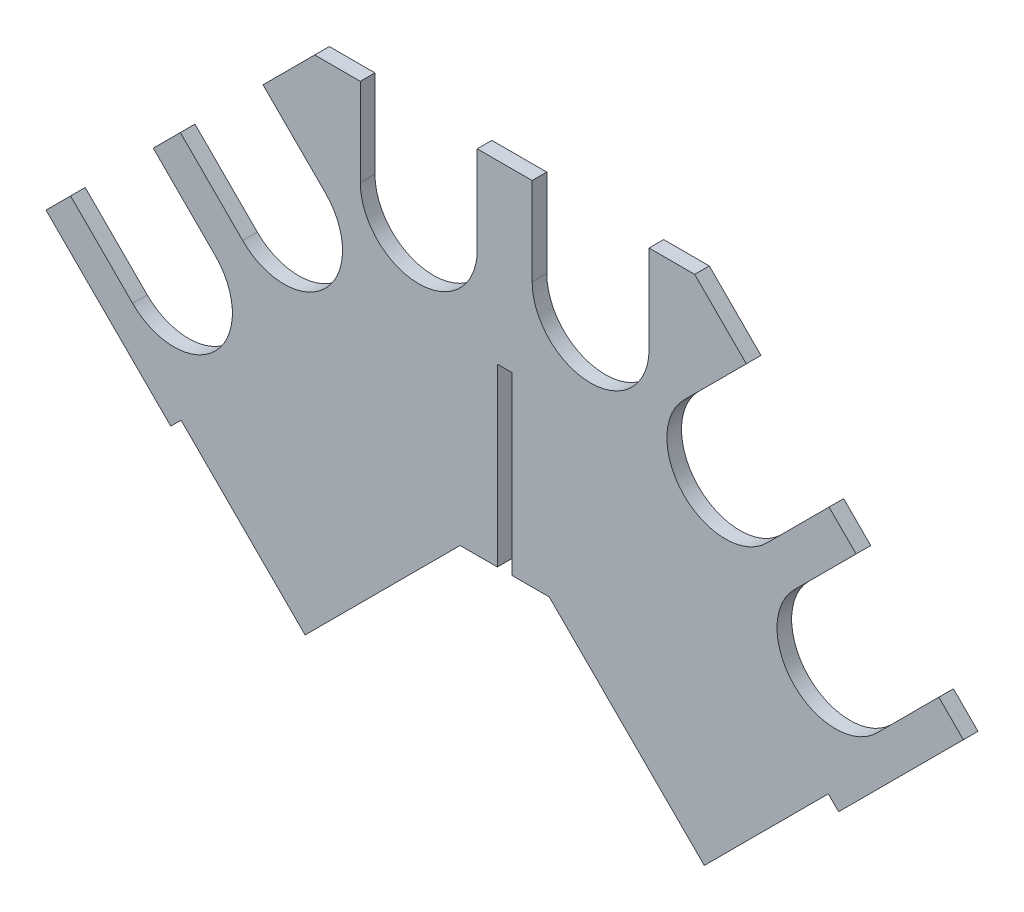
ISO-10303-21;
HEADER;
FILE_DESCRIPTION(('STEP AP214'),'2;1');
FILE_NAME('part.step','',(''),(''),'','','');
FILE_SCHEMA(('AUTOMOTIVE_DESIGN { 1 0 10303 214 1 1 1 1 }'));
ENDSEC;
DATA;
#1=APPLICATION_CONTEXT('core data for automotive mechanical design processes');
#2=APPLICATION_PROTOCOL_DEFINITION('international standard','automotive_design',2000,#1);
#3=PRODUCT_CONTEXT('',#1,'mechanical');
#4=PRODUCT('Part','Part','',(#3));
#5=PRODUCT_RELATED_PRODUCT_CATEGORY('part','',(#4));
#6=PRODUCT_DEFINITION_FORMATION('','',#4);
#7=PRODUCT_DEFINITION_CONTEXT('part definition',#1,'design');
#8=PRODUCT_DEFINITION('design','',#6,#7);
#9=PRODUCT_DEFINITION_SHAPE('','',#8);
#10=(LENGTH_UNIT() NAMED_UNIT(*) SI_UNIT(.MILLI.,.METRE.));
#11=(NAMED_UNIT(*) PLANE_ANGLE_UNIT() SI_UNIT($,.RADIAN.));
#12=(NAMED_UNIT(*) SI_UNIT($,.STERADIAN.) SOLID_ANGLE_UNIT());
#13=UNCERTAINTY_MEASURE_WITH_UNIT(LENGTH_MEASURE(1.E-05),#10,'distance_accuracy_value','');
#14=(GEOMETRIC_REPRESENTATION_CONTEXT(3) GLOBAL_UNCERTAINTY_ASSIGNED_CONTEXT((#13)) GLOBAL_UNIT_ASSIGNED_CONTEXT((#10,
#11,#12)) REPRESENTATION_CONTEXT('',''));
#15=CARTESIAN_POINT('',(0.,0.,0.));
#16=DIRECTION('',(0.,0.,1.));
#17=DIRECTION('',(1.,0.,0.));
#18=AXIS2_PLACEMENT_3D('',#15,#16,#17);
#19=CARTESIAN_POINT('',(-165.1,632.073318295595,12.7));
#20=DIRECTION('',(0.707106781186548,-0.707106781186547,0.));
#21=DIRECTION('',(0.707106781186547,0.707106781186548,0.));
#22=AXIS2_PLACEMENT_3D('',#19,#20,#21);
#23=PLANE('',#22);
#24=DIRECTION('',(-0.707106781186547,-0.707106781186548,0.));
#25=VECTOR('',#24,1.);
#26=CARTESIAN_POINT('',(-165.1,632.073318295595,0.));
#27=LINE('',#26,#25);
#28=CARTESIAN_POINT('',(-281.843329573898,515.329988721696,0.));
#29=VERTEX_POINT('',#28);
#30=CARTESIAN_POINT('',(-305.383457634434,491.789860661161,0.));
#31=VERTEX_POINT('',#30);
#32=EDGE_CURVE('E311',#29,#31,#27,.T.);
#33=ORIENTED_EDGE('',*,*,#32,.T.);
#34=DIRECTION('',(0.,0.,1.));
#35=VECTOR('',#34,1.);
#36=CARTESIAN_POINT('',(-305.383457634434,491.789860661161,-0.000999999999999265));
#37=LINE('',#36,#35);
#38=CARTESIAN_POINT('',(-305.383457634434,491.789860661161,12.7));
#39=VERTEX_POINT('',#38);
#40=EDGE_CURVE('E296',#31,#39,#37,.T.);
#41=ORIENTED_EDGE('',*,*,#40,.T.);
#42=DIRECTION('',(-0.707106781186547,-0.707106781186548,0.));
#43=VECTOR('',#42,1.);
#44=CARTESIAN_POINT('',(-165.1,632.073318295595,12.7));
#45=LINE('',#44,#43);
#46=CARTESIAN_POINT('',(-281.843329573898,515.329988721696,12.7));
#47=VERTEX_POINT('',#46);
#48=EDGE_CURVE('E553',#47,#39,#45,.T.);
#49=ORIENTED_EDGE('',*,*,#48,.F.);
#50=DIRECTION('',(0.,0.,1.));
#51=VECTOR('',#50,1.);
#52=CARTESIAN_POINT('',(-281.843329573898,515.329988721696,-0.000999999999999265));
#53=LINE('',#52,#51);
#54=EDGE_CURVE('E598',#29,#47,#53,.T.);
#55=ORIENTED_EDGE('',*,*,#54,.F.);
#56=EDGE_LOOP('',(#33,#41,#49,#55));
#57=FACE_BOUND('',#56,.T.);
#58=ADVANCED_FACE('F31',(#57),#23,.F.);
#59=CARTESIAN_POINT('',(-287.422945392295,401.987299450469,12.7));
#60=DIRECTION('',(0.,0.,-1.));
#61=DIRECTION('',(-1.,0.,0.));
#62=AXIS2_PLACEMENT_3D('',#59,#60,#61);
#63=CYLINDRICAL_SURFACE('',#62,50.8);
#64=CARTESIAN_POINT('',(-287.422945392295,401.987299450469,12.7));
#65=DIRECTION('',(0.,0.,1.));
#66=DIRECTION('',(1.,0.,0.));
#67=AXIS2_PLACEMENT_3D('',#64,#65,#66);
#68=CIRCLE('',#67,50.8);
#69=CARTESIAN_POINT('',(-323.343969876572,366.066274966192,12.7));
#70=VERTEX_POINT('',#69);
#71=CARTESIAN_POINT('',(-251.501920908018,437.908323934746,12.7));
#72=VERTEX_POINT('',#71);
#73=EDGE_CURVE('E516',#70,#72,#68,.T.);
#74=ORIENTED_EDGE('',*,*,#73,.T.);
#75=DIRECTION('',(0.,0.,1.));
#76=VECTOR('',#75,1.);
#77=CARTESIAN_POINT('',(-251.501920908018,437.908323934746,-0.000999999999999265));
#78=LINE('',#77,#76);
#79=CARTESIAN_POINT('',(-251.501920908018,437.908323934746,0.));
#80=VERTEX_POINT('',#79);
#81=EDGE_CURVE('E600',#80,#72,#78,.T.);
#82=ORIENTED_EDGE('',*,*,#81,.F.);
#83=CARTESIAN_POINT('',(-287.422945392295,401.987299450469,0.));
#84=DIRECTION('',(0.,0.,1.));
#85=DIRECTION('',(1.,0.,0.));
#86=AXIS2_PLACEMENT_3D('',#83,#84,#85);
#87=CIRCLE('',#86,50.8);
#88=CARTESIAN_POINT('',(-323.343969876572,366.066274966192,0.));
#89=VERTEX_POINT('',#88);
#90=EDGE_CURVE('E513',#89,#80,#87,.T.);
#91=ORIENTED_EDGE('',*,*,#90,.F.);
#92=DIRECTION('',(0.,0.,1.));
#93=VECTOR('',#92,1.);
#94=CARTESIAN_POINT('',(-323.343969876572,366.066274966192,-0.000999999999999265));
#95=LINE('',#94,#93);
#96=EDGE_CURVE('E290',#89,#70,#95,.T.);
#97=ORIENTED_EDGE('',*,*,#96,.T.);
#98=EDGE_LOOP('',(#74,#82,#91,#97));
#99=FACE_BOUND('',#98,.T.);
#100=ADVANCED_FACE('F674',(#99),#63,.F.);
#101=CARTESIAN_POINT('',(-377.225506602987,419.947811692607,12.7));
#102=VERTEX_POINT('',#101);
#103=CARTESIAN_POINT('',(-398.586659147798,398.586659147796,12.7));
#104=VERTEX_POINT('',#103);
#105=EDGE_CURVE('E304',#102,#104,#45,.T.);
#106=ORIENTED_EDGE('',*,*,#105,.F.);
#107=DIRECTION('',(0.,0.,1.));
#108=VECTOR('',#107,1.);
#109=CARTESIAN_POINT('',(-377.225506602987,419.947811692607,-0.000999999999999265));
#110=LINE('',#109,#108);
#111=CARTESIAN_POINT('',(-377.225506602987,419.947811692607,0.));
#112=VERTEX_POINT('',#111);
#113=EDGE_CURVE('E289',#112,#102,#110,.T.);
#114=ORIENTED_EDGE('',*,*,#113,.F.);
#115=CARTESIAN_POINT('',(-398.586659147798,398.586659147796,0.));
#116=VERTEX_POINT('',#115);
#117=EDGE_CURVE('E302',#112,#116,#27,.T.);
#118=ORIENTED_EDGE('',*,*,#117,.T.);
#119=DIRECTION('',(0.,0.,-1.));
#120=VECTOR('',#119,1.);
#121=CARTESIAN_POINT('',(-398.586659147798,398.586659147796,12.7));
#122=LINE('',#121,#120);
#123=EDGE_CURVE('E354',#104,#116,#122,.T.);
#124=ORIENTED_EDGE('',*,*,#123,.F.);
#125=EDGE_LOOP('',(#106,#114,#118,#124));
#126=FACE_BOUND('',#125,.T.);
#127=ADVANCED_FACE('F300',(#126),#23,.F.);
#128=CARTESIAN_POINT('',(-165.1,632.073318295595,12.7));
#129=DIRECTION('',(0.,-1.,0.));
#130=DIRECTION('',(1.,0.,0.));
#131=AXIS2_PLACEMENT_3D('',#128,#129,#130);
#132=PLANE('',#131);
#133=DIRECTION('',(-1.,0.,0.));
#134=VECTOR('',#133,1.);
#135=CARTESIAN_POINT('',(-165.1,632.073318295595,0.));
#136=LINE('',#135,#134);
#137=CARTESIAN_POINT('',(23.8592316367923,632.073318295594,0.));
#138=VERTEX_POINT('',#137);
#139=CARTESIAN_POINT('',(-23.8592316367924,632.073318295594,0.));
#140=VERTEX_POINT('',#139);
#141=EDGE_CURVE('E317',#138,#140,#136,.T.);
#142=ORIENTED_EDGE('',*,*,#141,.T.);
#143=DIRECTION('',(0.,0.,1.));
#144=VECTOR('',#143,1.);
#145=CARTESIAN_POINT('',(-23.8592316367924,632.073318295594,-0.000999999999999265));
#146=LINE('',#145,#144);
#147=CARTESIAN_POINT('',(-23.8592316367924,632.073318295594,12.7));
#148=VERTEX_POINT('',#147);
#149=EDGE_CURVE('E442',#140,#148,#146,.T.);
#150=ORIENTED_EDGE('',*,*,#149,.T.);
#151=DIRECTION('',(-1.,0.,0.));
#152=VECTOR('',#151,1.);
#153=CARTESIAN_POINT('',(-165.1,632.073318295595,12.7));
#154=LINE('',#153,#152);
#155=CARTESIAN_POINT('',(23.8592316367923,632.073318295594,12.7));
#156=VERTEX_POINT('',#155);
#157=EDGE_CURVE('E548',#156,#148,#154,.T.);
#158=ORIENTED_EDGE('',*,*,#157,.F.);
#159=DIRECTION('',(0.,0.,1.));
#160=VECTOR('',#159,1.);
#161=CARTESIAN_POINT('',(23.8592316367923,632.073318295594,-0.000999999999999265));
#162=LINE('',#161,#160);
#163=EDGE_CURVE('E447',#138,#156,#162,.T.);
#164=ORIENTED_EDGE('',*,*,#163,.F.);
#165=EDGE_LOOP('',(#142,#150,#158,#164));
#166=FACE_BOUND('',#165,.T.);
#167=ADVANCED_FACE('F654',(#166),#132,.F.);
#168=CARTESIAN_POINT('',(-74.6592316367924,555.873318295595,12.7));
#169=DIRECTION('',(0.,0.,-1.));
#170=DIRECTION('',(-1.,0.,0.));
#171=AXIS2_PLACEMENT_3D('',#168,#169,#170);
#172=CYLINDRICAL_SURFACE('',#171,50.8);
#173=CARTESIAN_POINT('',(-74.6592316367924,555.873318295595,12.7));
#174=DIRECTION('',(0.,0.,1.));
#175=DIRECTION('',(1.,0.,0.));
#176=AXIS2_PLACEMENT_3D('',#173,#174,#175);
#177=CIRCLE('',#176,50.8);
#178=CARTESIAN_POINT('',(-125.459231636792,555.873318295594,12.7));
#179=VERTEX_POINT('',#178);
#180=CARTESIAN_POINT('',(-23.8592316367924,555.873318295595,12.7));
#181=VERTEX_POINT('',#180);
#182=EDGE_CURVE('E494',#179,#181,#177,.T.);
#183=ORIENTED_EDGE('',*,*,#182,.T.);
#184=DIRECTION('',(0.,0.,1.));
#185=VECTOR('',#184,1.);
#186=CARTESIAN_POINT('',(-23.8592316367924,555.873318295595,-0.000999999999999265));
#187=LINE('',#186,#185);
#188=CARTESIAN_POINT('',(-23.8592316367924,555.873318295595,0.));
#189=VERTEX_POINT('',#188);
#190=EDGE_CURVE('E630',#189,#181,#187,.T.);
#191=ORIENTED_EDGE('',*,*,#190,.F.);
#192=CARTESIAN_POINT('',(-74.6592316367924,555.873318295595,0.));
#193=DIRECTION('',(0.,0.,1.));
#194=DIRECTION('',(1.,0.,0.));
#195=AXIS2_PLACEMENT_3D('',#192,#193,#194);
#196=CIRCLE('',#195,50.8);
#197=CARTESIAN_POINT('',(-125.459231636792,555.873318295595,0.));
#198=VERTEX_POINT('',#197);
#199=EDGE_CURVE('E493',#198,#189,#196,.T.);
#200=ORIENTED_EDGE('',*,*,#199,.F.);
#201=DIRECTION('',(0.,0.,1.));
#202=VECTOR('',#201,1.);
#203=CARTESIAN_POINT('',(-125.459231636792,555.873318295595,-0.000999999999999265));
#204=LINE('',#203,#202);
#205=EDGE_CURVE('E632',#198,#179,#204,.T.);
#206=ORIENTED_EDGE('',*,*,#205,.T.);
#207=EDGE_LOOP('',(#183,#191,#200,#206));
#208=FACE_BOUND('',#207,.T.);
#209=ADVANCED_FACE('F662',(#208),#172,.F.);
#210=CARTESIAN_POINT('',(165.1,632.073318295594,0.));
#211=VERTEX_POINT('',#210);
#212=CARTESIAN_POINT('',(125.459231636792,632.073318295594,0.));
#213=VERTEX_POINT('',#212);
#214=EDGE_CURVE('E312',#211,#213,#136,.T.);
#215=ORIENTED_EDGE('',*,*,#214,.T.);
#216=DIRECTION('',(0.,0.,1.));
#217=VECTOR('',#216,1.);
#218=CARTESIAN_POINT('',(125.459231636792,632.073318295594,-0.000999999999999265));
#219=LINE('',#218,#217);
#220=CARTESIAN_POINT('',(125.459231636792,632.073318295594,12.7));
#221=VERTEX_POINT('',#220);
#222=EDGE_CURVE('E448',#213,#221,#219,.T.);
#223=ORIENTED_EDGE('',*,*,#222,.T.);
#224=CARTESIAN_POINT('',(165.1,632.073318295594,12.7));
#225=VERTEX_POINT('',#224);
#226=EDGE_CURVE('E428',#225,#221,#154,.T.);
#227=ORIENTED_EDGE('',*,*,#226,.F.);
#228=DIRECTION('',(0.,0.,-1.));
#229=VECTOR('',#228,1.);
#230=CARTESIAN_POINT('',(165.1,632.073318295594,12.7));
#231=LINE('',#230,#229);
#232=EDGE_CURVE('E358',#225,#211,#231,.T.);
#233=ORIENTED_EDGE('',*,*,#232,.T.);
#234=EDGE_LOOP('',(#215,#223,#227,#233));
#235=FACE_BOUND('',#234,.T.);
#236=ADVANCED_FACE('F425',(#235),#132,.F.);
#237=CARTESIAN_POINT('',(74.6592316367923,555.873318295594,12.7));
#238=DIRECTION('',(0.,0.,-1.));
#239=DIRECTION('',(-1.,0.,0.));
#240=AXIS2_PLACEMENT_3D('',#237,#238,#239);
#241=CYLINDRICAL_SURFACE('',#240,50.8);
#242=CARTESIAN_POINT('',(74.6592316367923,555.873318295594,12.7));
#243=DIRECTION('',(0.,0.,1.));
#244=DIRECTION('',(1.,0.,0.));
#245=AXIS2_PLACEMENT_3D('',#242,#243,#244);
#246=CIRCLE('',#245,50.8);
#247=CARTESIAN_POINT('',(23.8592316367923,555.873318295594,12.7));
#248=VERTEX_POINT('',#247);
#249=CARTESIAN_POINT('',(125.459231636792,555.873318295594,12.7));
#250=VERTEX_POINT('',#249);
#251=EDGE_CURVE('E499',#248,#250,#246,.T.);
#252=ORIENTED_EDGE('',*,*,#251,.T.);
#253=DIRECTION('',(0.,0.,1.));
#254=VECTOR('',#253,1.);
#255=CARTESIAN_POINT('',(125.459231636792,555.873318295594,-0.000999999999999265));
#256=LINE('',#255,#254);
#257=CARTESIAN_POINT('',(125.459231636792,555.873318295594,0.));
#258=VERTEX_POINT('',#257);
#259=EDGE_CURVE('E451',#258,#250,#256,.T.);
#260=ORIENTED_EDGE('',*,*,#259,.F.);
#261=CARTESIAN_POINT('',(74.6592316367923,555.873318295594,0.));
#262=DIRECTION('',(0.,0.,1.));
#263=DIRECTION('',(1.,0.,0.));
#264=AXIS2_PLACEMENT_3D('',#261,#262,#263);
#265=CIRCLE('',#264,50.8);
#266=CARTESIAN_POINT('',(23.8592316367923,555.873318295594,0.));
#267=VERTEX_POINT('',#266);
#268=EDGE_CURVE('E434',#267,#258,#265,.T.);
#269=ORIENTED_EDGE('',*,*,#268,.F.);
#270=DIRECTION('',(0.,0.,1.));
#271=VECTOR('',#270,1.);
#272=CARTESIAN_POINT('',(23.8592316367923,555.873318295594,-0.000999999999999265));
#273=LINE('',#272,#271);
#274=EDGE_CURVE('E453',#267,#248,#273,.T.);
#275=ORIENTED_EDGE('',*,*,#274,.T.);
#276=EDGE_LOOP('',(#252,#260,#269,#275));
#277=FACE_BOUND('',#276,.T.);
#278=ADVANCED_FACE('F669',(#277),#241,.F.);
#279=CARTESIAN_POINT('',(165.1,632.073318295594,12.7));
#280=DIRECTION('',(-0.707106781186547,-0.707106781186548,0.));
#281=DIRECTION('',(0.707106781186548,-0.707106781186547,0.));
#282=AXIS2_PLACEMENT_3D('',#279,#280,#281);
#283=PLANE('',#282);
#284=DIRECTION('',(-0.707106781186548,0.707106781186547,0.));
#285=VECTOR('',#284,1.);
#286=CARTESIAN_POINT('',(165.1,632.073318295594,12.7));
#287=LINE('',#286,#285);
#288=CARTESIAN_POINT('',(305.383457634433,491.789860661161,12.7));
#289=VERTEX_POINT('',#288);
#290=CARTESIAN_POINT('',(281.843329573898,515.329988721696,12.7));
#291=VERTEX_POINT('',#290);
#292=EDGE_CURVE('E546',#289,#291,#287,.T.);
#293=ORIENTED_EDGE('',*,*,#292,.F.);
#294=DIRECTION('',(0.,0.,1.));
#295=VECTOR('',#294,1.);
#296=CARTESIAN_POINT('',(305.383457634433,491.789860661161,-0.000999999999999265));
#297=LINE('',#296,#295);
#298=CARTESIAN_POINT('',(305.383457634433,491.789860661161,0.));
#299=VERTEX_POINT('',#298);
#300=EDGE_CURVE('E469',#299,#289,#297,.T.);
#301=ORIENTED_EDGE('',*,*,#300,.F.);
#302=DIRECTION('',(-0.707106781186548,0.707106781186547,0.));
#303=VECTOR('',#302,1.);
#304=CARTESIAN_POINT('',(165.1,632.073318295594,0.));
#305=LINE('',#304,#303);
#306=CARTESIAN_POINT('',(281.843329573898,515.329988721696,0.));
#307=VERTEX_POINT('',#306);
#308=EDGE_CURVE('E410',#299,#307,#305,.T.);
#309=ORIENTED_EDGE('',*,*,#308,.T.);
#310=DIRECTION('',(0.,0.,1.));
#311=VECTOR('',#310,1.);
#312=CARTESIAN_POINT('',(281.843329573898,515.329988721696,-0.000999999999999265));
#313=LINE('',#312,#311);
#314=EDGE_CURVE('E488',#307,#291,#313,.T.);
#315=ORIENTED_EDGE('',*,*,#314,.T.);
#316=EDGE_LOOP('',(#293,#301,#309,#315));
#317=FACE_BOUND('',#316,.T.);
#318=ADVANCED_FACE('F695',(#317),#283,.F.);
#319=CARTESIAN_POINT('',(210.001280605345,587.172037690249,12.7));
#320=VERTEX_POINT('',#319);
#321=EDGE_CURVE('E541',#320,#225,#287,.T.);
#322=ORIENTED_EDGE('',*,*,#321,.F.);
#323=DIRECTION('',(0.,0.,1.));
#324=VECTOR('',#323,1.);
#325=CARTESIAN_POINT('',(210.001280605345,587.172037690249,-0.000999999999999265));
#326=LINE('',#325,#324);
#327=CARTESIAN_POINT('',(210.001280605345,587.172037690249,0.));
#328=VERTEX_POINT('',#327);
#329=EDGE_CURVE('E421',#328,#320,#326,.T.);
#330=ORIENTED_EDGE('',*,*,#329,.F.);
#331=EDGE_CURVE('E407',#328,#211,#305,.T.);
#332=ORIENTED_EDGE('',*,*,#331,.T.);
#333=ORIENTED_EDGE('',*,*,#232,.F.);
#334=EDGE_LOOP('',(#322,#330,#332,#333));
#335=FACE_BOUND('',#334,.T.);
#336=ADVANCED_FACE('F419',(#335),#283,.F.);
#337=CARTESIAN_POINT('',(-6.35,478.770757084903,12.7));
#338=DIRECTION('',(0.,0.,1.));
#339=DIRECTION('',(1.,0.,0.));
#340=AXIS2_PLACEMENT_3D('',#337,#338,#339);
#341=PLANE('',#340);
#342=DIRECTION('',(-0.707106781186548,0.707106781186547,0.));
#343=VECTOR('',#342,1.);
#344=CARTESIAN_POINT('',(-305.383457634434,491.789860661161,12.7));
#345=LINE('',#344,#343);
#346=EDGE_CURVE('E305',#72,#39,#345,.T.);
#347=ORIENTED_EDGE('',*,*,#346,.F.);
#348=ORIENTED_EDGE('',*,*,#73,.F.);
#349=DIRECTION('',(0.707106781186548,-0.707106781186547,0.));
#350=VECTOR('',#349,1.);
#351=CARTESIAN_POINT('',(-377.225506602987,419.947811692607,12.7));
#352=LINE('',#351,#350);
#353=EDGE_CURVE('E54',#102,#70,#352,.T.);
#354=ORIENTED_EDGE('',*,*,#353,.F.);
#355=ORIENTED_EDGE('',*,*,#105,.T.);
#356=DIRECTION('',(0.707106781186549,-0.707106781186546,0.));
#357=VECTOR('',#356,1.);
#358=CARTESIAN_POINT('',(-290.185378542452,290.185378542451,12.7));
#359=LINE('',#358,#357);
#360=CARTESIAN_POINT('',(-290.185378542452,290.185378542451,12.7));
#361=VERTEX_POINT('',#360);
#362=EDGE_CURVE('E552',#104,#361,#359,.T.);
#363=ORIENTED_EDGE('',*,*,#362,.T.);
#364=DIRECTION('',(0.707106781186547,0.707106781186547,0.));
#365=VECTOR('',#364,1.);
#366=CARTESIAN_POINT('',(-290.185378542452,290.185378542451,12.7));
#367=LINE('',#366,#365);
#368=CARTESIAN_POINT('',(-281.205122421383,299.16563466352,12.7));
#369=VERTEX_POINT('',#368);
#370=EDGE_CURVE('E555',#361,#369,#367,.T.);
#371=ORIENTED_EDGE('',*,*,#370,.T.);
#372=DIRECTION('',(0.707106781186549,-0.707106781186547,0.));
#373=VECTOR('',#372,1.);
#374=CARTESIAN_POINT('',(-281.205122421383,299.16563466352,12.7));
#375=LINE('',#374,#373);
#376=CARTESIAN_POINT('',(-173.442048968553,191.402561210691,12.7));
#377=VERTEX_POINT('',#376);
#378=EDGE_CURVE('E557',#369,#377,#375,.T.);
#379=ORIENTED_EDGE('',*,*,#378,.T.);
#380=DIRECTION('',(0.707106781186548,0.707106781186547,0.));
#381=VECTOR('',#380,1.);
#382=CARTESIAN_POINT('',(-173.442048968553,191.402561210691,12.7));
#383=LINE('',#382,#381);
#384=CARTESIAN_POINT('',(-38.7382071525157,326.106403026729,12.7));
#385=VERTEX_POINT('',#384);
#386=EDGE_CURVE('E559',#377,#385,#383,.T.);
#387=ORIENTED_EDGE('',*,*,#386,.T.);
#388=DIRECTION('',(1.,0.,0.));
#389=VECTOR('',#388,1.);
#390=CARTESIAN_POINT('',(-38.7382071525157,326.106403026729,12.7));
#391=LINE('',#390,#389);
#392=CARTESIAN_POINT('',(-6.35,326.106403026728,12.7));
#393=VERTEX_POINT('',#392);
#394=EDGE_CURVE('E343',#385,#393,#391,.T.);
#395=ORIENTED_EDGE('',*,*,#394,.T.);
#396=DIRECTION('',(0.,1.,0.));
#397=VECTOR('',#396,1.);
#398=CARTESIAN_POINT('',(-6.35,478.770757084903,12.7));
#399=LINE('',#398,#397);
#400=CARTESIAN_POINT('',(-6.35,478.770757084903,12.7));
#401=VERTEX_POINT('',#400);
#402=EDGE_CURVE('E338',#393,#401,#399,.T.);
#403=ORIENTED_EDGE('',*,*,#402,.T.);
#404=DIRECTION('',(1.,0.,0.));
#405=VECTOR('',#404,1.);
#406=CARTESIAN_POINT('',(-6.35,478.770757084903,12.7));
#407=LINE('',#406,#405);
#408=CARTESIAN_POINT('',(6.35,478.770757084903,12.7));
#409=VERTEX_POINT('',#408);
#410=EDGE_CURVE('E528',#401,#409,#407,.T.);
#411=ORIENTED_EDGE('',*,*,#410,.T.);
#412=DIRECTION('',(0.,-1.,0.));
#413=VECTOR('',#412,1.);
#414=CARTESIAN_POINT('',(6.35,478.770757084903,12.7));
#415=LINE('',#414,#413);
#416=CARTESIAN_POINT('',(6.35,326.106403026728,12.7));
#417=VERTEX_POINT('',#416);
#418=EDGE_CURVE('E386',#409,#417,#415,.T.);
#419=ORIENTED_EDGE('',*,*,#418,.T.);
#420=DIRECTION('',(1.,0.,0.));
#421=VECTOR('',#420,1.);
#422=CARTESIAN_POINT('',(6.35,326.106403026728,12.7));
#423=LINE('',#422,#421);
#424=CARTESIAN_POINT('',(38.7382071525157,326.106403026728,12.7));
#425=VERTEX_POINT('',#424);
#426=EDGE_CURVE('E531',#417,#425,#423,.T.);
#427=ORIENTED_EDGE('',*,*,#426,.T.);
#428=DIRECTION('',(0.707106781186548,-0.707106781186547,0.));
#429=VECTOR('',#428,1.);
#430=CARTESIAN_POINT('',(173.442048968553,191.402561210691,12.7));
#431=LINE('',#430,#429);
#432=CARTESIAN_POINT('',(173.442048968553,191.402561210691,12.7));
#433=VERTEX_POINT('',#432);
#434=EDGE_CURVE('E533',#425,#433,#431,.T.);
#435=ORIENTED_EDGE('',*,*,#434,.T.);
#436=DIRECTION('',(0.707106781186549,0.707106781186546,0.));
#437=VECTOR('',#436,1.);
#438=CARTESIAN_POINT('',(173.442048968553,191.402561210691,12.7));
#439=LINE('',#438,#437);
#440=CARTESIAN_POINT('',(281.205122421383,299.16563466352,12.7));
#441=VERTEX_POINT('',#440);
#442=EDGE_CURVE('E535',#433,#441,#439,.T.);
#443=ORIENTED_EDGE('',*,*,#442,.T.);
#444=DIRECTION('',(0.707106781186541,-0.707106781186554,0.));
#445=VECTOR('',#444,1.);
#446=CARTESIAN_POINT('',(281.205122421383,299.16563466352,12.7));
#447=LINE('',#446,#445);
#448=CARTESIAN_POINT('',(290.185378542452,290.185378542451,12.7));
#449=VERTEX_POINT('',#448);
#450=EDGE_CURVE('E537',#441,#449,#447,.T.);
#451=ORIENTED_EDGE('',*,*,#450,.T.);
#452=DIRECTION('',(0.707106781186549,0.707106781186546,0.));
#453=VECTOR('',#452,1.);
#454=CARTESIAN_POINT('',(290.185378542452,290.185378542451,12.7));
#455=LINE('',#454,#453);
#456=CARTESIAN_POINT('',(398.586659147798,398.586659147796,12.7));
#457=VERTEX_POINT('',#456);
#458=EDGE_CURVE('E539',#449,#457,#455,.T.);
#459=ORIENTED_EDGE('',*,*,#458,.T.);
#460=CARTESIAN_POINT('',(377.225506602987,419.947811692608,12.7));
#461=VERTEX_POINT('',#460);
#462=EDGE_CURVE('E542',#457,#461,#287,.T.);
#463=ORIENTED_EDGE('',*,*,#462,.T.);
#464=DIRECTION('',(0.707106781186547,0.707106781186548,0.));
#465=VECTOR('',#464,1.);
#466=CARTESIAN_POINT('',(323.343969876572,366.066274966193,12.7));
#467=LINE('',#466,#465);
#468=CARTESIAN_POINT('',(323.343969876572,366.066274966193,12.7));
#469=VERTEX_POINT('',#468);
#470=EDGE_CURVE('E460',#469,#461,#467,.T.);
#471=ORIENTED_EDGE('',*,*,#470,.F.);
#472=CARTESIAN_POINT('',(287.422945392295,401.987299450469,12.7));
#473=DIRECTION('',(0.,0.,1.));
#474=DIRECTION('',(1.,0.,0.));
#475=AXIS2_PLACEMENT_3D('',#472,#473,#474);
#476=CIRCLE('',#475,50.8);
#477=CARTESIAN_POINT('',(251.501920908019,437.908323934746,12.7));
#478=VERTEX_POINT('',#477);
#479=EDGE_CURVE('E521',#478,#469,#476,.T.);
#480=ORIENTED_EDGE('',*,*,#479,.F.);
#481=DIRECTION('',(-0.707106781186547,-0.707106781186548,0.));
#482=VECTOR('',#481,1.);
#483=CARTESIAN_POINT('',(251.501920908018,437.908323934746,12.7));
#484=LINE('',#483,#482);
#485=EDGE_CURVE('E462',#289,#478,#484,.T.);
#486=ORIENTED_EDGE('',*,*,#485,.F.);
#487=ORIENTED_EDGE('',*,*,#292,.T.);
#488=DIRECTION('',(0.707106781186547,0.707106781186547,0.));
#489=VECTOR('',#488,1.);
#490=CARTESIAN_POINT('',(227.642689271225,461.129348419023,12.7));
#491=LINE('',#490,#489);
#492=CARTESIAN_POINT('',(227.642689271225,461.129348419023,12.7));
#493=VERTEX_POINT('',#492);
#494=EDGE_CURVE('E477',#493,#291,#491,.T.);
#495=ORIENTED_EDGE('',*,*,#494,.F.);
#496=CARTESIAN_POINT('',(191.721664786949,497.050372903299,12.7));
#497=DIRECTION('',(0.,0.,1.));
#498=DIRECTION('',(1.,0.,0.));
#499=AXIS2_PLACEMENT_3D('',#496,#497,#498);
#500=CIRCLE('',#499,50.8);
#501=CARTESIAN_POINT('',(155.800640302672,532.971397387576,12.7));
#502=VERTEX_POINT('',#501);
#503=EDGE_CURVE('E504',#502,#493,#500,.T.);
#504=ORIENTED_EDGE('',*,*,#503,.F.);
#505=DIRECTION('',(-0.707106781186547,-0.707106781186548,0.));
#506=VECTOR('',#505,1.);
#507=CARTESIAN_POINT('',(210.001280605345,587.172037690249,12.7));
#508=LINE('',#507,#506);
#509=EDGE_CURVE('E480',#320,#502,#508,.T.);
#510=ORIENTED_EDGE('',*,*,#509,.F.);
#511=ORIENTED_EDGE('',*,*,#321,.T.);
#512=ORIENTED_EDGE('',*,*,#226,.T.);
#513=DIRECTION('',(0.,1.,0.));
#514=VECTOR('',#513,1.);
#515=CARTESIAN_POINT('',(125.459231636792,632.073318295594,12.7));
#516=LINE('',#515,#514);
#517=EDGE_CURVE('E440',#250,#221,#516,.T.);
#518=ORIENTED_EDGE('',*,*,#517,.F.);
#519=ORIENTED_EDGE('',*,*,#251,.F.);
#520=DIRECTION('',(0.,-1.,0.));
#521=VECTOR('',#520,1.);
#522=CARTESIAN_POINT('',(23.8592316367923,632.073318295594,12.7));
#523=LINE('',#522,#521);
#524=EDGE_CURVE('E437',#156,#248,#523,.T.);
#525=ORIENTED_EDGE('',*,*,#524,.F.);
#526=ORIENTED_EDGE('',*,*,#157,.T.);
#527=DIRECTION('',(0.,1.,0.));
#528=VECTOR('',#527,1.);
#529=CARTESIAN_POINT('',(-23.8592316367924,632.073318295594,12.7));
#530=LINE('',#529,#528);
#531=EDGE_CURVE('E625',#181,#148,#530,.T.);
#532=ORIENTED_EDGE('',*,*,#531,.F.);
#533=ORIENTED_EDGE('',*,*,#182,.F.);
#534=DIRECTION('',(0.,-1.,0.));
#535=VECTOR('',#534,1.);
#536=CARTESIAN_POINT('',(-125.459231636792,632.073318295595,12.7));
#537=LINE('',#536,#535);
#538=CARTESIAN_POINT('',(-125.459231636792,632.073318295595,12.7));
#539=VERTEX_POINT('',#538);
#540=EDGE_CURVE('E623',#539,#179,#537,.T.);
#541=ORIENTED_EDGE('',*,*,#540,.F.);
#542=CARTESIAN_POINT('',(-165.1,632.073318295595,12.7));
#543=VERTEX_POINT('',#542);
#544=EDGE_CURVE('E545',#539,#543,#154,.T.);
#545=ORIENTED_EDGE('',*,*,#544,.T.);
#546=CARTESIAN_POINT('',(-210.001280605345,587.172037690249,12.7));
#547=VERTEX_POINT('',#546);
#548=EDGE_CURVE('E549',#543,#547,#45,.T.);
#549=ORIENTED_EDGE('',*,*,#548,.T.);
#550=DIRECTION('',(-0.707106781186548,0.707106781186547,0.));
#551=VECTOR('',#550,1.);
#552=CARTESIAN_POINT('',(-210.001280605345,587.172037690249,12.7));
#553=LINE('',#552,#551);
#554=CARTESIAN_POINT('',(-155.800640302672,532.971397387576,12.7));
#555=VERTEX_POINT('',#554);
#556=EDGE_CURVE('E608',#555,#547,#553,.T.);
#557=ORIENTED_EDGE('',*,*,#556,.F.);
#558=CARTESIAN_POINT('',(-191.721664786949,497.0503729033,12.7));
#559=DIRECTION('',(0.,0.,1.));
#560=DIRECTION('',(1.,0.,0.));
#561=AXIS2_PLACEMENT_3D('',#558,#559,#560);
#562=CIRCLE('',#561,50.8);
#563=CARTESIAN_POINT('',(-227.642689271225,461.129348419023,12.7));
#564=VERTEX_POINT('',#563);
#565=EDGE_CURVE('E510',#564,#555,#562,.T.);
#566=ORIENTED_EDGE('',*,*,#565,.F.);
#567=DIRECTION('',(0.707106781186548,-0.707106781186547,0.));
#568=VECTOR('',#567,1.);
#569=CARTESIAN_POINT('',(-281.843329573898,515.329988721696,12.7));
#570=LINE('',#569,#568);
#571=EDGE_CURVE('E594',#47,#564,#570,.T.);
#572=ORIENTED_EDGE('',*,*,#571,.F.);
#573=ORIENTED_EDGE('',*,*,#48,.T.);
#574=EDGE_LOOP('',(#347,#348,#354,#355,#363,#371,#379,#387,#395,#403,#411,#419,#427,#435,#443,
#451,#459,#463,#471,#480,#486,#487,#495,#504,#510,#511,#512,#518,#519,#525,#526,#532,#533,#541,
#545,#549,#557,#566,#572,#573));
#575=FACE_BOUND('',#574,.T.);
#576=ADVANCED_FACE('F588',(#575),#341,.T.);
#577=CARTESIAN_POINT('',(-6.35,478.770757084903,0.));
#578=DIRECTION('',(0.,0.,1.));
#579=DIRECTION('',(1.,0.,0.));
#580=AXIS2_PLACEMENT_3D('',#577,#578,#579);
#581=PLANE('',#580);
#582=ORIENTED_EDGE('',*,*,#90,.T.);
#583=DIRECTION('',(0.707106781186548,-0.707106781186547,0.));
#584=VECTOR('',#583,1.);
#585=CARTESIAN_POINT('',(-305.383457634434,491.789860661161,0.));
#586=LINE('',#585,#584);
#587=EDGE_CURVE('E46',#31,#80,#586,.T.);
#588=ORIENTED_EDGE('',*,*,#587,.F.);
#589=ORIENTED_EDGE('',*,*,#32,.F.);
#590=DIRECTION('',(-0.707106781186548,0.707106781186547,0.));
#591=VECTOR('',#590,1.);
#592=CARTESIAN_POINT('',(-281.843329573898,515.329988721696,0.));
#593=LINE('',#592,#591);
#594=CARTESIAN_POINT('',(-227.642689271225,461.129348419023,0.));
#595=VERTEX_POINT('',#594);
#596=EDGE_CURVE('E295',#595,#29,#593,.T.);
#597=ORIENTED_EDGE('',*,*,#596,.F.);
#598=CARTESIAN_POINT('',(-191.721664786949,497.0503729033,0.));
#599=DIRECTION('',(0.,0.,1.));
#600=DIRECTION('',(1.,0.,0.));
#601=AXIS2_PLACEMENT_3D('',#598,#599,#600);
#602=CIRCLE('',#601,50.8);
#603=CARTESIAN_POINT('',(-155.800640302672,532.971397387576,0.));
#604=VERTEX_POINT('',#603);
#605=EDGE_CURVE('E507',#595,#604,#602,.T.);
#606=ORIENTED_EDGE('',*,*,#605,.T.);
#607=DIRECTION('',(0.707106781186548,-0.707106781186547,0.));
#608=VECTOR('',#607,1.);
#609=CARTESIAN_POINT('',(-210.001280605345,587.172037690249,0.));
#610=LINE('',#609,#608);
#611=CARTESIAN_POINT('',(-210.001280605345,587.172037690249,0.));
#612=VERTEX_POINT('',#611);
#613=EDGE_CURVE('E615',#612,#604,#610,.T.);
#614=ORIENTED_EDGE('',*,*,#613,.F.);
#615=CARTESIAN_POINT('',(-165.1,632.073318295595,0.));
#616=VERTEX_POINT('',#615);
#617=EDGE_CURVE('E314',#616,#612,#27,.T.);
#618=ORIENTED_EDGE('',*,*,#617,.F.);
#619=CARTESIAN_POINT('',(-125.459231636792,632.073318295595,0.));
#620=VERTEX_POINT('',#619);
#621=EDGE_CURVE('E319',#620,#616,#136,.T.);
#622=ORIENTED_EDGE('',*,*,#621,.F.);
#623=DIRECTION('',(0.,1.,0.));
#624=VECTOR('',#623,1.);
#625=CARTESIAN_POINT('',(-125.459231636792,632.073318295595,0.));
#626=LINE('',#625,#624);
#627=EDGE_CURVE('E438',#198,#620,#626,.T.);
#628=ORIENTED_EDGE('',*,*,#627,.F.);
#629=ORIENTED_EDGE('',*,*,#199,.T.);
#630=DIRECTION('',(0.,-1.,0.));
#631=VECTOR('',#630,1.);
#632=CARTESIAN_POINT('',(-23.8592316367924,632.073318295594,0.));
#633=LINE('',#632,#631);
#634=EDGE_CURVE('E621',#140,#189,#633,.T.);
#635=ORIENTED_EDGE('',*,*,#634,.F.);
#636=ORIENTED_EDGE('',*,*,#141,.F.);
#637=DIRECTION('',(0.,1.,0.));
#638=VECTOR('',#637,1.);
#639=CARTESIAN_POINT('',(23.8592316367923,632.073318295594,0.));
#640=LINE('',#639,#638);
#641=EDGE_CURVE('E450',#267,#138,#640,.T.);
#642=ORIENTED_EDGE('',*,*,#641,.F.);
#643=ORIENTED_EDGE('',*,*,#268,.T.);
#644=DIRECTION('',(0.,-1.,0.));
#645=VECTOR('',#644,1.);
#646=CARTESIAN_POINT('',(125.459231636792,632.073318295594,0.));
#647=LINE('',#646,#645);
#648=EDGE_CURVE('E431',#213,#258,#647,.T.);
#649=ORIENTED_EDGE('',*,*,#648,.F.);
#650=ORIENTED_EDGE('',*,*,#214,.F.);
#651=ORIENTED_EDGE('',*,*,#331,.F.);
#652=DIRECTION('',(0.707106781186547,0.707106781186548,0.));
#653=VECTOR('',#652,1.);
#654=CARTESIAN_POINT('',(210.001280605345,587.172037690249,0.));
#655=LINE('',#654,#653);
#656=CARTESIAN_POINT('',(155.800640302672,532.971397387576,0.));
#657=VERTEX_POINT('',#656);
#658=EDGE_CURVE('E475',#657,#328,#655,.T.);
#659=ORIENTED_EDGE('',*,*,#658,.F.);
#660=CARTESIAN_POINT('',(191.721664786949,497.050372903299,0.));
#661=DIRECTION('',(0.,0.,1.));
#662=DIRECTION('',(1.,0.,0.));
#663=AXIS2_PLACEMENT_3D('',#660,#661,#662);
#664=CIRCLE('',#663,50.8);
#665=CARTESIAN_POINT('',(227.642689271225,461.129348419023,0.));
#666=VERTEX_POINT('',#665);
#667=EDGE_CURVE('E502',#657,#666,#664,.T.);
#668=ORIENTED_EDGE('',*,*,#667,.T.);
#669=DIRECTION('',(-0.707106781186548,-0.707106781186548,0.));
#670=VECTOR('',#669,1.);
#671=CARTESIAN_POINT('',(227.642689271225,461.129348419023,0.));
#672=LINE('',#671,#670);
#673=EDGE_CURVE('E486',#307,#666,#672,.T.);
#674=ORIENTED_EDGE('',*,*,#673,.F.);
#675=ORIENTED_EDGE('',*,*,#308,.F.);
#676=DIRECTION('',(0.707106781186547,0.707106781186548,0.));
#677=VECTOR('',#676,1.);
#678=CARTESIAN_POINT('',(251.501920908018,437.908323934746,0.));
#679=LINE('',#678,#677);
#680=CARTESIAN_POINT('',(251.501920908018,437.908323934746,0.));
#681=VERTEX_POINT('',#680);
#682=EDGE_CURVE('E458',#681,#299,#679,.T.);
#683=ORIENTED_EDGE('',*,*,#682,.F.);
#684=CARTESIAN_POINT('',(287.422945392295,401.987299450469,0.));
#685=DIRECTION('',(0.,0.,1.));
#686=DIRECTION('',(1.,0.,0.));
#687=AXIS2_PLACEMENT_3D('',#684,#685,#686);
#688=CIRCLE('',#687,50.8);
#689=CARTESIAN_POINT('',(323.343969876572,366.066274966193,0.));
#690=VERTEX_POINT('',#689);
#691=EDGE_CURVE('E519',#681,#690,#688,.T.);
#692=ORIENTED_EDGE('',*,*,#691,.T.);
#693=DIRECTION('',(-0.707106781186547,-0.707106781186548,0.));
#694=VECTOR('',#693,1.);
#695=CARTESIAN_POINT('',(323.343969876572,366.066274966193,0.));
#696=LINE('',#695,#694);
#697=CARTESIAN_POINT('',(377.225506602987,419.947811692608,0.));
#698=VERTEX_POINT('',#697);
#699=EDGE_CURVE('E468',#698,#690,#696,.T.);
#700=ORIENTED_EDGE('',*,*,#699,.F.);
#701=CARTESIAN_POINT('',(398.586659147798,398.586659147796,0.));
#702=VERTEX_POINT('',#701);
#703=EDGE_CURVE('E408',#702,#698,#305,.T.);
#704=ORIENTED_EDGE('',*,*,#703,.F.);
#705=DIRECTION('',(0.707106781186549,0.707106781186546,0.));
#706=VECTOR('',#705,1.);
#707=CARTESIAN_POINT('',(290.185378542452,290.185378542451,0.));
#708=LINE('',#707,#706);
#709=CARTESIAN_POINT('',(290.185378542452,290.185378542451,0.));
#710=VERTEX_POINT('',#709);
#711=EDGE_CURVE('E405',#710,#702,#708,.T.);
#712=ORIENTED_EDGE('',*,*,#711,.F.);
#713=DIRECTION('',(0.707106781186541,-0.707106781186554,0.));
#714=VECTOR('',#713,1.);
#715=CARTESIAN_POINT('',(281.205122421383,299.16563466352,0.));
#716=LINE('',#715,#714);
#717=CARTESIAN_POINT('',(281.205122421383,299.16563466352,0.));
#718=VERTEX_POINT('',#717);
#719=EDGE_CURVE('E403',#718,#710,#716,.T.);
#720=ORIENTED_EDGE('',*,*,#719,.F.);
#721=DIRECTION('',(0.707106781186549,0.707106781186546,0.));
#722=VECTOR('',#721,1.);
#723=CARTESIAN_POINT('',(173.442048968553,191.402561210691,0.));
#724=LINE('',#723,#722);
#725=CARTESIAN_POINT('',(173.442048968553,191.402561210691,0.));
#726=VERTEX_POINT('',#725);
#727=EDGE_CURVE('E401',#726,#718,#724,.T.);
#728=ORIENTED_EDGE('',*,*,#727,.F.);
#729=DIRECTION('',(0.707106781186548,-0.707106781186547,0.));
#730=VECTOR('',#729,1.);
#731=CARTESIAN_POINT('',(173.442048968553,191.402561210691,0.));
#732=LINE('',#731,#730);
#733=CARTESIAN_POINT('',(38.7382071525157,326.106403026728,0.));
#734=VERTEX_POINT('',#733);
#735=EDGE_CURVE('E394',#734,#726,#732,.T.);
#736=ORIENTED_EDGE('',*,*,#735,.F.);
#737=DIRECTION('',(1.,0.,0.));
#738=VECTOR('',#737,1.);
#739=CARTESIAN_POINT('',(6.35,326.106403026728,0.));
#740=LINE('',#739,#738);
#741=CARTESIAN_POINT('',(6.35,326.106403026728,0.));
#742=VERTEX_POINT('',#741);
#743=EDGE_CURVE('E392',#742,#734,#740,.T.);
#744=ORIENTED_EDGE('',*,*,#743,.F.);
#745=DIRECTION('',(0.,-1.,0.));
#746=VECTOR('',#745,1.);
#747=CARTESIAN_POINT('',(6.35,478.770757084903,0.));
#748=LINE('',#747,#746);
#749=CARTESIAN_POINT('',(6.35,478.770757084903,0.));
#750=VERTEX_POINT('',#749);
#751=EDGE_CURVE('E385',#750,#742,#748,.T.);
#752=ORIENTED_EDGE('',*,*,#751,.F.);
#753=DIRECTION('',(1.,0.,0.));
#754=VECTOR('',#753,1.);
#755=CARTESIAN_POINT('',(-6.35,478.770757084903,0.));
#756=LINE('',#755,#754);
#757=CARTESIAN_POINT('',(-6.35,478.770757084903,0.));
#758=VERTEX_POINT('',#757);
#759=EDGE_CURVE('E390',#758,#750,#756,.T.);
#760=ORIENTED_EDGE('',*,*,#759,.F.);
#761=DIRECTION('',(0.,1.,0.));
#762=VECTOR('',#761,1.);
#763=CARTESIAN_POINT('',(-6.35,478.770757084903,0.));
#764=LINE('',#763,#762);
#765=CARTESIAN_POINT('',(-6.35,326.106403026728,0.));
#766=VERTEX_POINT('',#765);
#767=EDGE_CURVE('E396',#766,#758,#764,.T.);
#768=ORIENTED_EDGE('',*,*,#767,.F.);
#769=DIRECTION('',(1.,0.,0.));
#770=VECTOR('',#769,1.);
#771=CARTESIAN_POINT('',(-38.7382071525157,326.106403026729,0.));
#772=LINE('',#771,#770);
#773=CARTESIAN_POINT('',(-38.7382071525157,326.106403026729,0.));
#774=VERTEX_POINT('',#773);
#775=EDGE_CURVE('E336',#774,#766,#772,.T.);
#776=ORIENTED_EDGE('',*,*,#775,.F.);
#777=DIRECTION('',(0.707106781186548,0.707106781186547,0.));
#778=VECTOR('',#777,1.);
#779=CARTESIAN_POINT('',(-173.442048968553,191.402561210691,0.));
#780=LINE('',#779,#778);
#781=CARTESIAN_POINT('',(-173.442048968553,191.402561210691,0.));
#782=VERTEX_POINT('',#781);
#783=EDGE_CURVE('E334',#782,#774,#780,.T.);
#784=ORIENTED_EDGE('',*,*,#783,.F.);
#785=DIRECTION('',(0.707106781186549,-0.707106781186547,0.));
#786=VECTOR('',#785,1.);
#787=CARTESIAN_POINT('',(-281.205122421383,299.16563466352,0.));
#788=LINE('',#787,#786);
#789=CARTESIAN_POINT('',(-281.205122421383,299.16563466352,0.));
#790=VERTEX_POINT('',#789);
#791=EDGE_CURVE('E330',#790,#782,#788,.T.);
#792=ORIENTED_EDGE('',*,*,#791,.F.);
#793=DIRECTION('',(0.707106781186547,0.707106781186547,0.));
#794=VECTOR('',#793,1.);
#795=CARTESIAN_POINT('',(-290.185378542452,290.185378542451,0.));
#796=LINE('',#795,#794);
#797=CARTESIAN_POINT('',(-290.185378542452,290.185378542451,0.));
#798=VERTEX_POINT('',#797);
#799=EDGE_CURVE('E326',#798,#790,#796,.T.);
#800=ORIENTED_EDGE('',*,*,#799,.F.);
#801=DIRECTION('',(0.707106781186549,-0.707106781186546,0.));
#802=VECTOR('',#801,1.);
#803=CARTESIAN_POINT('',(-290.185378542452,290.185378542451,0.));
#804=LINE('',#803,#802);
#805=EDGE_CURVE('E310',#116,#798,#804,.T.);
#806=ORIENTED_EDGE('',*,*,#805,.F.);
#807=ORIENTED_EDGE('',*,*,#117,.F.);
#808=DIRECTION('',(-0.707106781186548,0.707106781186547,0.));
#809=VECTOR('',#808,1.);
#810=CARTESIAN_POINT('',(-377.225506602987,419.947811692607,0.));
#811=LINE('',#810,#809);
#812=EDGE_CURVE('E286',#89,#112,#811,.T.);
#813=ORIENTED_EDGE('',*,*,#812,.F.);
#814=EDGE_LOOP('',(#582,#588,#589,#597,#606,#614,#618,#622,#628,#629,#635,#636,#642,#643,#649,
#650,#651,#659,#668,#674,#675,#683,#692,#700,#704,#712,#720,#728,#736,#744,#752,#760,#768,#776,
#784,#792,#800,#806,#807,#813));
#815=FACE_BOUND('',#814,.T.);
#816=ADVANCED_FACE('F308',(#815),#581,.F.);
#817=CARTESIAN_POINT('',(-6.35,478.770757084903,12.7));
#818=DIRECTION('',(-1.,0.,0.));
#819=DIRECTION('',(0.,0.,1.));
#820=AXIS2_PLACEMENT_3D('',#817,#818,#819);
#821=PLANE('',#820);
#822=ORIENTED_EDGE('',*,*,#767,.T.);
#823=DIRECTION('',(0.,0.,-1.));
#824=VECTOR('',#823,1.);
#825=CARTESIAN_POINT('',(-6.35,478.770757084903,12.7));
#826=LINE('',#825,#824);
#827=EDGE_CURVE('E11',#401,#758,#826,.T.);
#828=ORIENTED_EDGE('',*,*,#827,.F.);
#829=ORIENTED_EDGE('',*,*,#402,.F.);
#830=DIRECTION('',(0.,0.,-1.));
#831=VECTOR('',#830,1.);
#832=CARTESIAN_POINT('',(-6.35,326.106403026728,12.7));
#833=LINE('',#832,#831);
#834=EDGE_CURVE('E339',#393,#766,#833,.T.);
#835=ORIENTED_EDGE('',*,*,#834,.T.);
#836=EDGE_LOOP('',(#822,#828,#829,#835));
#837=FACE_BOUND('',#836,.T.);
#838=ADVANCED_FACE('F33',(#837),#821,.F.);
#839=CARTESIAN_POINT('',(-6.35,478.770757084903,12.7));
#840=DIRECTION('',(0.,1.,0.));
#841=DIRECTION('',(0.,0.,1.));
#842=AXIS2_PLACEMENT_3D('',#839,#840,#841);
#843=PLANE('',#842);
#844=ORIENTED_EDGE('',*,*,#759,.T.);
#845=DIRECTION('',(0.,0.,-1.));
#846=VECTOR('',#845,1.);
#847=CARTESIAN_POINT('',(6.35,478.770757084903,12.7));
#848=LINE('',#847,#846);
#849=EDGE_CURVE('E39',#409,#750,#848,.T.);
#850=ORIENTED_EDGE('',*,*,#849,.F.);
#851=ORIENTED_EDGE('',*,*,#410,.F.);
#852=ORIENTED_EDGE('',*,*,#827,.T.);
#853=EDGE_LOOP('',(#844,#850,#851,#852));
#854=FACE_BOUND('',#853,.T.);
#855=ADVANCED_FACE('F717',(#854),#843,.F.);
#856=CARTESIAN_POINT('',(6.35,478.770757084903,12.7));
#857=DIRECTION('',(1.,0.,0.));
#858=DIRECTION('',(0.,0.,-1.));
#859=AXIS2_PLACEMENT_3D('',#856,#857,#858);
#860=PLANE('',#859);
#861=ORIENTED_EDGE('',*,*,#751,.T.);
#862=DIRECTION('',(0.,0.,-1.));
#863=VECTOR('',#862,1.);
#864=CARTESIAN_POINT('',(6.35,326.106403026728,12.7));
#865=LINE('',#864,#863);
#866=EDGE_CURVE('E376',#417,#742,#865,.T.);
#867=ORIENTED_EDGE('',*,*,#866,.F.);
#868=ORIENTED_EDGE('',*,*,#418,.F.);
#869=ORIENTED_EDGE('',*,*,#849,.T.);
#870=EDGE_LOOP('',(#861,#867,#868,#869));
#871=FACE_BOUND('',#870,.T.);
#872=ADVANCED_FACE('F383',(#871),#860,.F.);
#873=CARTESIAN_POINT('',(6.35,326.106403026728,12.7));
#874=DIRECTION('',(0.,1.,0.));
#875=DIRECTION('',(-1.,0.,0.));
#876=AXIS2_PLACEMENT_3D('',#873,#874,#875);
#877=PLANE('',#876);
#878=ORIENTED_EDGE('',*,*,#743,.T.);
#879=DIRECTION('',(0.,0.,-1.));
#880=VECTOR('',#879,1.);
#881=CARTESIAN_POINT('',(38.7382071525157,326.106403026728,12.7));
#882=LINE('',#881,#880);
#883=EDGE_CURVE('E373',#425,#734,#882,.T.);
#884=ORIENTED_EDGE('',*,*,#883,.F.);
#885=ORIENTED_EDGE('',*,*,#426,.F.);
#886=ORIENTED_EDGE('',*,*,#866,.T.);
#887=EDGE_LOOP('',(#878,#884,#885,#886));
#888=FACE_BOUND('',#887,.T.);
#889=ADVANCED_FACE('F711',(#888),#877,.F.);
#890=CARTESIAN_POINT('',(173.442048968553,191.402561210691,12.7));
#891=DIRECTION('',(0.707106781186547,0.707106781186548,0.));
#892=DIRECTION('',(-0.707106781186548,0.707106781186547,0.));
#893=AXIS2_PLACEMENT_3D('',#890,#891,#892);
#894=PLANE('',#893);
#895=ORIENTED_EDGE('',*,*,#735,.T.);
#896=DIRECTION('',(0.,0.,-1.));
#897=VECTOR('',#896,1.);
#898=CARTESIAN_POINT('',(173.442048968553,191.402561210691,12.7));
#899=LINE('',#898,#897);
#900=EDGE_CURVE('E370',#433,#726,#899,.T.);
#901=ORIENTED_EDGE('',*,*,#900,.F.);
#902=ORIENTED_EDGE('',*,*,#434,.F.);
#903=ORIENTED_EDGE('',*,*,#883,.T.);
#904=EDGE_LOOP('',(#895,#901,#902,#903));
#905=FACE_BOUND('',#904,.T.);
#906=ADVANCED_FACE('F707',(#905),#894,.F.);
#907=CARTESIAN_POINT('',(173.442048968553,191.402561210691,12.7));
#908=DIRECTION('',(-0.707106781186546,0.707106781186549,0.));
#909=DIRECTION('',(-0.707106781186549,-0.707106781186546,0.));
#910=AXIS2_PLACEMENT_3D('',#907,#908,#909);
#911=PLANE('',#910);
#912=ORIENTED_EDGE('',*,*,#727,.T.);
#913=DIRECTION('',(0.,0.,-1.));
#914=VECTOR('',#913,1.);
#915=CARTESIAN_POINT('',(281.205122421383,299.16563466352,12.7));
#916=LINE('',#915,#914);
#917=EDGE_CURVE('E367',#441,#718,#916,.T.);
#918=ORIENTED_EDGE('',*,*,#917,.F.);
#919=ORIENTED_EDGE('',*,*,#442,.F.);
#920=ORIENTED_EDGE('',*,*,#900,.T.);
#921=EDGE_LOOP('',(#912,#918,#919,#920));
#922=FACE_BOUND('',#921,.T.);
#923=ADVANCED_FACE('F703',(#922),#911,.F.);
#924=CARTESIAN_POINT('',(281.205122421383,299.16563466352,12.7));
#925=DIRECTION('',(0.707106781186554,0.707106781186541,0.));
#926=DIRECTION('',(-0.707106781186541,0.707106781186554,0.));
#927=AXIS2_PLACEMENT_3D('',#924,#925,#926);
#928=PLANE('',#927);
#929=ORIENTED_EDGE('',*,*,#719,.T.);
#930=DIRECTION('',(0.,0.,-1.));
#931=VECTOR('',#930,1.);
#932=CARTESIAN_POINT('',(290.185378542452,290.185378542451,12.7));
#933=LINE('',#932,#931);
#934=EDGE_CURVE('E364',#449,#710,#933,.T.);
#935=ORIENTED_EDGE('',*,*,#934,.F.);
#936=ORIENTED_EDGE('',*,*,#450,.F.);
#937=ORIENTED_EDGE('',*,*,#917,.T.);
#938=EDGE_LOOP('',(#929,#935,#936,#937));
#939=FACE_BOUND('',#938,.T.);
#940=ADVANCED_FACE('F699',(#939),#928,.F.);
#941=CARTESIAN_POINT('',(290.185378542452,290.185378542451,12.7));
#942=DIRECTION('',(-0.707106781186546,0.707106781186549,0.));
#943=DIRECTION('',(-0.707106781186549,-0.707106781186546,0.));
#944=AXIS2_PLACEMENT_3D('',#941,#942,#943);
#945=PLANE('',#944);
#946=ORIENTED_EDGE('',*,*,#711,.T.);
#947=DIRECTION('',(0.,0.,-1.));
#948=VECTOR('',#947,1.);
#949=CARTESIAN_POINT('',(398.586659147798,398.586659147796,12.7));
#950=LINE('',#949,#948);
#951=EDGE_CURVE('E361',#457,#702,#950,.T.);
#952=ORIENTED_EDGE('',*,*,#951,.F.);
#953=ORIENTED_EDGE('',*,*,#458,.F.);
#954=ORIENTED_EDGE('',*,*,#934,.T.);
#955=EDGE_LOOP('',(#946,#952,#953,#954));
#956=FACE_BOUND('',#955,.T.);
#957=ADVANCED_FACE('F693',(#956),#945,.F.);
#958=ORIENTED_EDGE('',*,*,#703,.T.);
#959=DIRECTION('',(0.,0.,1.));
#960=VECTOR('',#959,1.);
#961=CARTESIAN_POINT('',(377.225506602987,419.947811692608,-0.000999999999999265));
#962=LINE('',#961,#960);
#963=EDGE_CURVE('E471',#698,#461,#962,.T.);
#964=ORIENTED_EDGE('',*,*,#963,.T.);
#965=ORIENTED_EDGE('',*,*,#462,.F.);
#966=ORIENTED_EDGE('',*,*,#951,.T.);
#967=EDGE_LOOP('',(#958,#964,#965,#966));
#968=FACE_BOUND('',#967,.T.);
#969=ADVANCED_FACE('F689',(#968),#283,.F.);
#970=ORIENTED_EDGE('',*,*,#544,.F.);
#971=DIRECTION('',(0.,0.,1.));
#972=VECTOR('',#971,1.);
#973=CARTESIAN_POINT('',(-125.459231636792,632.073318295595,-0.000999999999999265));
#974=LINE('',#973,#972);
#975=EDGE_CURVE('E627',#620,#539,#974,.T.);
#976=ORIENTED_EDGE('',*,*,#975,.F.);
#977=ORIENTED_EDGE('',*,*,#621,.T.);
#978=DIRECTION('',(0.,0.,-1.));
#979=VECTOR('',#978,1.);
#980=CARTESIAN_POINT('',(-165.1,632.073318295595,12.7));
#981=LINE('',#980,#979);
#982=EDGE_CURVE('E356',#543,#616,#981,.T.);
#983=ORIENTED_EDGE('',*,*,#982,.F.);
#984=EDGE_LOOP('',(#970,#976,#977,#983));
#985=FACE_BOUND('',#984,.T.);
#986=ADVANCED_FACE('F645',(#985),#132,.F.);
#987=ORIENTED_EDGE('',*,*,#617,.T.);
#988=DIRECTION('',(0.,0.,1.));
#989=VECTOR('',#988,1.);
#990=CARTESIAN_POINT('',(-210.001280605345,587.172037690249,-0.000999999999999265));
#991=LINE('',#990,#989);
#992=EDGE_CURVE('E617',#612,#547,#991,.T.);
#993=ORIENTED_EDGE('',*,*,#992,.T.);
#994=ORIENTED_EDGE('',*,*,#548,.F.);
#995=ORIENTED_EDGE('',*,*,#982,.T.);
#996=EDGE_LOOP('',(#987,#993,#994,#995));
#997=FACE_BOUND('',#996,.T.);
#998=ADVANCED_FACE('F676',(#997),#23,.F.);
#999=CARTESIAN_POINT('',(-290.185378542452,290.185378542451,12.7));
#1000=DIRECTION('',(0.707106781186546,0.707106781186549,0.));
#1001=DIRECTION('',(-0.707106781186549,0.707106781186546,0.));
#1002=AXIS2_PLACEMENT_3D('',#999,#1000,#1001);
#1003=PLANE('',#1002);
#1004=ORIENTED_EDGE('',*,*,#805,.T.);
#1005=DIRECTION('',(0.,0.,-1.));
#1006=VECTOR('',#1005,1.);
#1007=CARTESIAN_POINT('',(-290.185378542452,290.185378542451,12.7));
#1008=LINE('',#1007,#1006);
#1009=EDGE_CURVE('E352',#361,#798,#1008,.T.);
#1010=ORIENTED_EDGE('',*,*,#1009,.F.);
#1011=ORIENTED_EDGE('',*,*,#362,.F.);
#1012=ORIENTED_EDGE('',*,*,#123,.T.);
#1013=EDGE_LOOP('',(#1004,#1010,#1011,#1012));
#1014=FACE_BOUND('',#1013,.T.);
#1015=ADVANCED_FACE('F585',(#1014),#1003,.F.);
#1016=CARTESIAN_POINT('',(-290.185378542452,290.185378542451,12.7));
#1017=DIRECTION('',(-0.707106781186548,0.707106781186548,0.));
#1018=DIRECTION('',(-0.707106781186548,-0.707106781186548,0.));
#1019=AXIS2_PLACEMENT_3D('',#1016,#1017,#1018);
#1020=PLANE('',#1019);
#1021=ORIENTED_EDGE('',*,*,#799,.T.);
#1022=DIRECTION('',(0.,0.,-1.));
#1023=VECTOR('',#1022,1.);
#1024=CARTESIAN_POINT('',(-281.205122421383,299.16563466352,12.7));
#1025=LINE('',#1024,#1023);
#1026=EDGE_CURVE('E349',#369,#790,#1025,.T.);
#1027=ORIENTED_EDGE('',*,*,#1026,.F.);
#1028=ORIENTED_EDGE('',*,*,#370,.F.);
#1029=ORIENTED_EDGE('',*,*,#1009,.T.);
#1030=EDGE_LOOP('',(#1021,#1027,#1028,#1029));
#1031=FACE_BOUND('',#1030,.T.);
#1032=ADVANCED_FACE('F582',(#1031),#1020,.F.);
#1033=CARTESIAN_POINT('',(-281.205122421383,299.16563466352,12.7));
#1034=DIRECTION('',(0.707106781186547,0.707106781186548,0.));
#1035=DIRECTION('',(-0.707106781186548,0.707106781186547,0.));
#1036=AXIS2_PLACEMENT_3D('',#1033,#1034,#1035);
#1037=PLANE('',#1036);
#1038=ORIENTED_EDGE('',*,*,#791,.T.);
#1039=DIRECTION('',(0.,0.,-1.));
#1040=VECTOR('',#1039,1.);
#1041=CARTESIAN_POINT('',(-173.442048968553,191.402561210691,12.7));
#1042=LINE('',#1041,#1040);
#1043=EDGE_CURVE('E346',#377,#782,#1042,.T.);
#1044=ORIENTED_EDGE('',*,*,#1043,.F.);
#1045=ORIENTED_EDGE('',*,*,#378,.F.);
#1046=ORIENTED_EDGE('',*,*,#1026,.T.);
#1047=EDGE_LOOP('',(#1038,#1044,#1045,#1046));
#1048=FACE_BOUND('',#1047,.T.);
#1049=ADVANCED_FACE('F579',(#1048),#1037,.F.);
#1050=CARTESIAN_POINT('',(-173.442048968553,191.402561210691,12.7));
#1051=DIRECTION('',(-0.707106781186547,0.707106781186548,0.));
#1052=DIRECTION('',(-0.707106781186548,-0.707106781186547,0.));
#1053=AXIS2_PLACEMENT_3D('',#1050,#1051,#1052);
#1054=PLANE('',#1053);
#1055=ORIENTED_EDGE('',*,*,#783,.T.);
#1056=DIRECTION('',(0.,0.,-1.));
#1057=VECTOR('',#1056,1.);
#1058=CARTESIAN_POINT('',(-38.7382071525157,326.106403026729,12.7));
#1059=LINE('',#1058,#1057);
#1060=EDGE_CURVE('E342',#385,#774,#1059,.T.);
#1061=ORIENTED_EDGE('',*,*,#1060,.F.);
#1062=ORIENTED_EDGE('',*,*,#386,.F.);
#1063=ORIENTED_EDGE('',*,*,#1043,.T.);
#1064=EDGE_LOOP('',(#1055,#1061,#1062,#1063));
#1065=FACE_BOUND('',#1064,.T.);
#1066=ADVANCED_FACE('F575',(#1065),#1054,.F.);
#1067=CARTESIAN_POINT('',(-38.7382071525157,326.106403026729,12.7));
#1068=DIRECTION('',(0.,1.,0.));
#1069=DIRECTION('',(-1.,0.,0.));
#1070=AXIS2_PLACEMENT_3D('',#1067,#1068,#1069);
#1071=PLANE('',#1070);
#1072=ORIENTED_EDGE('',*,*,#775,.T.);
#1073=ORIENTED_EDGE('',*,*,#834,.F.);
#1074=ORIENTED_EDGE('',*,*,#394,.F.);
#1075=ORIENTED_EDGE('',*,*,#1060,.T.);
#1076=EDGE_LOOP('',(#1072,#1073,#1074,#1075));
#1077=FACE_BOUND('',#1076,.T.);
#1078=ADVANCED_FACE('F570',(#1077),#1071,.F.);
#1079=CARTESIAN_POINT('',(287.422945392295,401.987299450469,12.7));
#1080=DIRECTION('',(0.,0.,-1.));
#1081=DIRECTION('',(-1.,0.,0.));
#1082=AXIS2_PLACEMENT_3D('',#1079,#1080,#1081);
#1083=CYLINDRICAL_SURFACE('',#1082,50.8);
#1084=DIRECTION('',(0.,0.,1.));
#1085=VECTOR('',#1084,1.);
#1086=CARTESIAN_POINT('',(251.501920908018,437.908323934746,-0.000999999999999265));
#1087=LINE('',#1086,#1085);
#1088=EDGE_CURVE('E465',#681,#478,#1087,.T.);
#1089=ORIENTED_EDGE('',*,*,#1088,.T.);
#1090=ORIENTED_EDGE('',*,*,#479,.T.);
#1091=DIRECTION('',(0.,0.,1.));
#1092=VECTOR('',#1091,1.);
#1093=CARTESIAN_POINT('',(323.343969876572,366.066274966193,-0.000999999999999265));
#1094=LINE('',#1093,#1092);
#1095=EDGE_CURVE('E464',#690,#469,#1094,.T.);
#1096=ORIENTED_EDGE('',*,*,#1095,.F.);
#1097=ORIENTED_EDGE('',*,*,#691,.F.);
#1098=EDGE_LOOP('',(#1089,#1090,#1096,#1097));
#1099=FACE_BOUND('',#1098,.T.);
#1100=ADVANCED_FACE('F746',(#1099),#1083,.F.);
#1101=CARTESIAN_POINT('',(-191.721664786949,497.0503729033,12.7));
#1102=DIRECTION('',(0.,0.,-1.));
#1103=DIRECTION('',(-1.,0.,0.));
#1104=AXIS2_PLACEMENT_3D('',#1101,#1102,#1103);
#1105=CYLINDRICAL_SURFACE('',#1104,50.8);
#1106=DIRECTION('',(0.,0.,1.));
#1107=VECTOR('',#1106,1.);
#1108=CARTESIAN_POINT('',(-227.642689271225,461.129348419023,-0.000999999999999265));
#1109=LINE('',#1108,#1107);
#1110=EDGE_CURVE('E612',#595,#564,#1109,.T.);
#1111=ORIENTED_EDGE('',*,*,#1110,.T.);
#1112=ORIENTED_EDGE('',*,*,#565,.T.);
#1113=DIRECTION('',(0.,0.,1.));
#1114=VECTOR('',#1113,1.);
#1115=CARTESIAN_POINT('',(-155.800640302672,532.971397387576,-0.000999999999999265));
#1116=LINE('',#1115,#1114);
#1117=EDGE_CURVE('E611',#604,#555,#1116,.T.);
#1118=ORIENTED_EDGE('',*,*,#1117,.F.);
#1119=ORIENTED_EDGE('',*,*,#605,.F.);
#1120=EDGE_LOOP('',(#1111,#1112,#1118,#1119));
#1121=FACE_BOUND('',#1120,.T.);
#1122=ADVANCED_FACE('F772',(#1121),#1105,.F.);
#1123=CARTESIAN_POINT('',(191.721664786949,497.050372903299,12.7));
#1124=DIRECTION('',(0.,0.,-1.));
#1125=DIRECTION('',(-1.,0.,0.));
#1126=AXIS2_PLACEMENT_3D('',#1123,#1124,#1125);
#1127=CYLINDRICAL_SURFACE('',#1126,50.8);
#1128=DIRECTION('',(0.,0.,1.));
#1129=VECTOR('',#1128,1.);
#1130=CARTESIAN_POINT('',(155.800640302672,532.971397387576,-0.000999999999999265));
#1131=LINE('',#1130,#1129);
#1132=EDGE_CURVE('E483',#657,#502,#1131,.T.);
#1133=ORIENTED_EDGE('',*,*,#1132,.T.);
#1134=ORIENTED_EDGE('',*,*,#503,.T.);
#1135=DIRECTION('',(0.,0.,1.));
#1136=VECTOR('',#1135,1.);
#1137=CARTESIAN_POINT('',(227.642689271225,461.129348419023,-0.000999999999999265));
#1138=LINE('',#1137,#1136);
#1139=EDGE_CURVE('E482',#666,#493,#1138,.T.);
#1140=ORIENTED_EDGE('',*,*,#1139,.F.);
#1141=ORIENTED_EDGE('',*,*,#667,.F.);
#1142=EDGE_LOOP('',(#1133,#1134,#1140,#1141));
#1143=FACE_BOUND('',#1142,.T.);
#1144=ADVANCED_FACE('F761',(#1143),#1127,.F.);
#1145=CARTESIAN_POINT('',(227.642689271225,461.129348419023,-0.000999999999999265));
#1146=DIRECTION('',(0.707106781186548,-0.707106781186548,0.));
#1147=DIRECTION('',(0.707106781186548,0.707106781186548,0.));
#1148=AXIS2_PLACEMENT_3D('',#1145,#1146,#1147);
#1149=PLANE('',#1148);
#1150=ORIENTED_EDGE('',*,*,#673,.T.);
#1151=ORIENTED_EDGE('',*,*,#1139,.T.);
#1152=ORIENTED_EDGE('',*,*,#494,.T.);
#1153=ORIENTED_EDGE('',*,*,#314,.F.);
#1154=EDGE_LOOP('',(#1150,#1151,#1152,#1153));
#1155=FACE_BOUND('',#1154,.T.);
#1156=ADVANCED_FACE('F765',(#1155),#1149,.F.);
#1157=CARTESIAN_POINT('',(210.001280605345,587.172037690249,-0.000999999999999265));
#1158=DIRECTION('',(-0.707106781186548,0.707106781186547,0.));
#1159=DIRECTION('',(-0.707106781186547,-0.707106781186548,0.));
#1160=AXIS2_PLACEMENT_3D('',#1157,#1158,#1159);
#1161=PLANE('',#1160);
#1162=ORIENTED_EDGE('',*,*,#658,.T.);
#1163=ORIENTED_EDGE('',*,*,#329,.T.);
#1164=ORIENTED_EDGE('',*,*,#509,.T.);
#1165=ORIENTED_EDGE('',*,*,#1132,.F.);
#1166=EDGE_LOOP('',(#1162,#1163,#1164,#1165));
#1167=FACE_BOUND('',#1166,.T.);
#1168=ADVANCED_FACE('F758',(#1167),#1161,.F.);
#1169=CARTESIAN_POINT('',(323.343969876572,366.066274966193,-0.000999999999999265));
#1170=DIRECTION('',(0.707106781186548,-0.707106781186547,0.));
#1171=DIRECTION('',(0.707106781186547,0.707106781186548,0.));
#1172=AXIS2_PLACEMENT_3D('',#1169,#1170,#1171);
#1173=PLANE('',#1172);
#1174=ORIENTED_EDGE('',*,*,#699,.T.);
#1175=ORIENTED_EDGE('',*,*,#1095,.T.);
#1176=ORIENTED_EDGE('',*,*,#470,.T.);
#1177=ORIENTED_EDGE('',*,*,#963,.F.);
#1178=EDGE_LOOP('',(#1174,#1175,#1176,#1177));
#1179=FACE_BOUND('',#1178,.T.);
#1180=ADVANCED_FACE('F740',(#1179),#1173,.F.);
#1181=CARTESIAN_POINT('',(251.501920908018,437.908323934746,-0.000999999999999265));
#1182=DIRECTION('',(-0.707106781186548,0.707106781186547,0.));
#1183=DIRECTION('',(-0.707106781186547,-0.707106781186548,0.));
#1184=AXIS2_PLACEMENT_3D('',#1181,#1182,#1183);
#1185=PLANE('',#1184);
#1186=ORIENTED_EDGE('',*,*,#682,.T.);
#1187=ORIENTED_EDGE('',*,*,#300,.T.);
#1188=ORIENTED_EDGE('',*,*,#485,.T.);
#1189=ORIENTED_EDGE('',*,*,#1088,.F.);
#1190=EDGE_LOOP('',(#1186,#1187,#1188,#1189));
#1191=FACE_BOUND('',#1190,.T.);
#1192=ADVANCED_FACE('F777',(#1191),#1185,.F.);
#1193=CARTESIAN_POINT('',(23.8592316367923,632.073318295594,-0.000999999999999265));
#1194=DIRECTION('',(-1.,0.,0.));
#1195=DIRECTION('',(0.,-1.,0.));
#1196=AXIS2_PLACEMENT_3D('',#1193,#1194,#1195);
#1197=PLANE('',#1196);
#1198=ORIENTED_EDGE('',*,*,#641,.T.);
#1199=ORIENTED_EDGE('',*,*,#163,.T.);
#1200=ORIENTED_EDGE('',*,*,#524,.T.);
#1201=ORIENTED_EDGE('',*,*,#274,.F.);
#1202=EDGE_LOOP('',(#1198,#1199,#1200,#1201));
#1203=FACE_BOUND('',#1202,.T.);
#1204=ADVANCED_FACE('F780',(#1203),#1197,.F.);
#1205=CARTESIAN_POINT('',(125.459231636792,632.073318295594,-0.000999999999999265));
#1206=DIRECTION('',(1.,0.,0.));
#1207=DIRECTION('',(0.,0.,-1.));
#1208=AXIS2_PLACEMENT_3D('',#1205,#1206,#1207);
#1209=PLANE('',#1208);
#1210=ORIENTED_EDGE('',*,*,#648,.T.);
#1211=ORIENTED_EDGE('',*,*,#259,.T.);
#1212=ORIENTED_EDGE('',*,*,#517,.T.);
#1213=ORIENTED_EDGE('',*,*,#222,.F.);
#1214=EDGE_LOOP('',(#1210,#1211,#1212,#1213));
#1215=FACE_BOUND('',#1214,.T.);
#1216=ADVANCED_FACE('F783',(#1215),#1209,.F.);
#1217=CARTESIAN_POINT('',(-125.459231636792,632.073318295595,-0.000999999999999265));
#1218=DIRECTION('',(-1.,0.,0.));
#1219=DIRECTION('',(0.,-1.,0.));
#1220=AXIS2_PLACEMENT_3D('',#1217,#1218,#1219);
#1221=PLANE('',#1220);
#1222=ORIENTED_EDGE('',*,*,#627,.T.);
#1223=ORIENTED_EDGE('',*,*,#975,.T.);
#1224=ORIENTED_EDGE('',*,*,#540,.T.);
#1225=ORIENTED_EDGE('',*,*,#205,.F.);
#1226=EDGE_LOOP('',(#1222,#1223,#1224,#1225));
#1227=FACE_BOUND('',#1226,.T.);
#1228=ADVANCED_FACE('F637',(#1227),#1221,.F.);
#1229=CARTESIAN_POINT('',(-23.8592316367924,632.073318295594,-0.000999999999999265));
#1230=DIRECTION('',(1.,0.,0.));
#1231=DIRECTION('',(0.,1.,0.));
#1232=AXIS2_PLACEMENT_3D('',#1229,#1230,#1231);
#1233=PLANE('',#1232);
#1234=ORIENTED_EDGE('',*,*,#634,.T.);
#1235=ORIENTED_EDGE('',*,*,#190,.T.);
#1236=ORIENTED_EDGE('',*,*,#531,.T.);
#1237=ORIENTED_EDGE('',*,*,#149,.F.);
#1238=EDGE_LOOP('',(#1234,#1235,#1236,#1237));
#1239=FACE_BOUND('',#1238,.T.);
#1240=ADVANCED_FACE('F658',(#1239),#1233,.F.);
#1241=CARTESIAN_POINT('',(-210.001280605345,587.172037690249,-0.000999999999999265));
#1242=DIRECTION('',(0.707106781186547,0.707106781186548,0.));
#1243=DIRECTION('',(-0.707106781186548,0.707106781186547,0.));
#1244=AXIS2_PLACEMENT_3D('',#1241,#1242,#1243);
#1245=PLANE('',#1244);
#1246=ORIENTED_EDGE('',*,*,#613,.T.);
#1247=ORIENTED_EDGE('',*,*,#1117,.T.);
#1248=ORIENTED_EDGE('',*,*,#556,.T.);
#1249=ORIENTED_EDGE('',*,*,#992,.F.);
#1250=EDGE_LOOP('',(#1246,#1247,#1248,#1249));
#1251=FACE_BOUND('',#1250,.T.);
#1252=ADVANCED_FACE('F791',(#1251),#1245,.F.);
#1253=CARTESIAN_POINT('',(-281.843329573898,515.329988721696,-0.000999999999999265));
#1254=DIRECTION('',(-0.707106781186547,-0.707106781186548,0.));
#1255=DIRECTION('',(0.707106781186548,-0.707106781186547,0.));
#1256=AXIS2_PLACEMENT_3D('',#1253,#1254,#1255);
#1257=PLANE('',#1256);
#1258=ORIENTED_EDGE('',*,*,#596,.T.);
#1259=ORIENTED_EDGE('',*,*,#54,.T.);
#1260=ORIENTED_EDGE('',*,*,#571,.T.);
#1261=ORIENTED_EDGE('',*,*,#1110,.F.);
#1262=EDGE_LOOP('',(#1258,#1259,#1260,#1261));
#1263=FACE_BOUND('',#1262,.T.);
#1264=ADVANCED_FACE('F794',(#1263),#1257,.F.);
#1265=CARTESIAN_POINT('',(-377.225506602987,419.947811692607,-0.000999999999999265));
#1266=DIRECTION('',(-0.707106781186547,-0.707106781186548,0.));
#1267=DIRECTION('',(0.707106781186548,-0.707106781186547,0.));
#1268=AXIS2_PLACEMENT_3D('',#1265,#1266,#1267);
#1269=PLANE('',#1268);
#1270=ORIENTED_EDGE('',*,*,#812,.T.);
#1271=ORIENTED_EDGE('',*,*,#113,.T.);
#1272=ORIENTED_EDGE('',*,*,#353,.T.);
#1273=ORIENTED_EDGE('',*,*,#96,.F.);
#1274=EDGE_LOOP('',(#1270,#1271,#1272,#1273));
#1275=FACE_BOUND('',#1274,.T.);
#1276=ADVANCED_FACE('F288',(#1275),#1269,.F.);
#1277=CARTESIAN_POINT('',(-305.383457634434,491.789860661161,-0.000999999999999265));
#1278=DIRECTION('',(0.707106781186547,0.707106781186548,0.));
#1279=DIRECTION('',(-0.707106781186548,0.707106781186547,0.));
#1280=AXIS2_PLACEMENT_3D('',#1277,#1278,#1279);
#1281=PLANE('',#1280);
#1282=ORIENTED_EDGE('',*,*,#587,.T.);
#1283=ORIENTED_EDGE('',*,*,#81,.T.);
#1284=ORIENTED_EDGE('',*,*,#346,.T.);
#1285=ORIENTED_EDGE('',*,*,#40,.F.);
#1286=EDGE_LOOP('',(#1282,#1283,#1284,#1285));
#1287=FACE_BOUND('',#1286,.T.);
#1288=ADVANCED_FACE('F801',(#1287),#1281,.F.);
#1289=CLOSED_SHELL('',(#58,#100,#127,#167,#209,#236,#278,#318,#336,#576,#816,#838,#855,#872,
#889,#906,#923,#940,#957,#969,#986,#998,#1015,#1032,#1049,#1066,#1078,#1100,#1122,#1144,#1156,
#1168,#1180,#1192,#1204,#1216,#1228,#1240,#1252,#1264,#1276,#1288));
#1290=MANIFOLD_SOLID_BREP('B2',#1289);
#1291=ADVANCED_BREP_SHAPE_REPRESENTATION('',(#18,#1290),#14);
#1292=SHAPE_DEFINITION_REPRESENTATION(#9,#1291);
ENDSEC;
END-ISO-10303-21;
